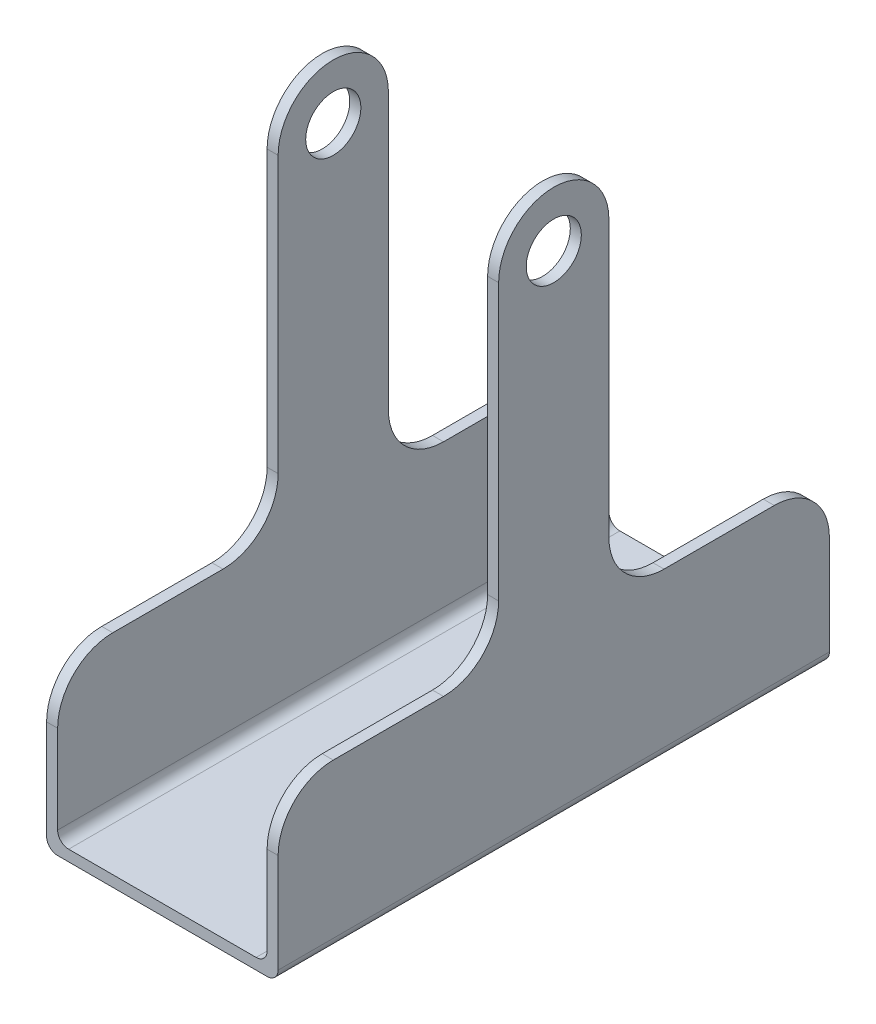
from build123d import *

# Parameters (mm, degrees)
SKETCH1_W          = 19
SKETCH1_H          = 50
EXTRUDE1_DEPTH     = 1
SKETCH3_W          = 50
SKETCH3_H          = 50
SKETCH3_R          = 2.5
EXTRUDE2_DEPTH     = 1
EXTRUDE3_START     = 1
SKETCH4_W          = 50
SKETCH4_H          = 50
SKETCH4_R          = 2.5
EXTRUDE3_DEPTH     = 1
CUT_EXTRUDE1_DEPTH = 74.763134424
FILLET1_R          = 1
FILLET2_R          = 1
FILLET3_R          = 1


with BuildPart() as part:
    # Sketch1 → Extrude1 (new body)
    with BuildSketch(Plane(origin=(0, 0, 0), x_dir=(1, 0, 0), z_dir=(0, 1, 0))):
        with Locations((9.5, 25)):
            Rectangle(SKETCH1_W, SKETCH1_H)
    extrude(amount=EXTRUDE1_DEPTH)

    # Sketch3 → Extrude2 (add)
    with BuildSketch(Plane(origin=(19, 0, 0), x_dir=(0, 0, -1), z_dir=(1, 0, 0))):
        with Locations((25, 25)):
            Rectangle(SKETCH3_W, SKETCH3_H)
        with Locations((25, 45)):
            Circle(SKETCH3_R, mode=Mode.SUBTRACT)
    extrude(amount=EXTRUDE2_DEPTH)

    # Sketch4 → Extrude3 (add)
    with BuildSketch(Plane.ZY.offset(EXTRUDE3_START)):
        with Locations((-25, 25)):
            Rectangle(SKETCH4_W, SKETCH4_H)
        with Locations(Location((-25, 45, 0), (0, 0, 180))):
            Circle(SKETCH4_R, mode=Mode.SUBTRACT)
    extrude(amount=-EXTRUDE3_DEPTH)

    # Sketch5 → Cut-Extrude1 (cut, through all)
    with BuildSketch(Plane.ZY.offset(1)):
        with BuildLine():
            Line((-30, 45), (-30, 20))
            ThreePointArc((-30, 20), (-31.464466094, 16.464466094), (-35, 15))
            Line((-35, 15), (-45, 15))
            ThreePointArc((-45, 15), (-48.535533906, 13.535533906), (-50, 10))
            Line((-50, 10), (-63.781665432, 10))
            Line((-63.781665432, 10), (-63.781665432, 64.035685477))
            Line((-63.781665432, 64.035685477), (11.670472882, 64.035685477))
            Line((11.670472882, 64.035685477), (11.670472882, 10))
            Line((11.670472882, 10), (0, 10))
            ThreePointArc((0, 10), (-1.464466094, 13.535533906), (-5, 15))
            Line((-5, 15), (-15, 15))
            ThreePointArc((-15, 15), (-18.535533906, 16.464466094), (-20, 20))
            Line((-20, 20), (-20, 45))
            ThreePointArc((-20, 45), (-25, 50), (-30, 45))
        make_face()
    extrude(amount=-CUT_EXTRUDE1_DEPTH, mode=Mode.SUBTRACT)

    # Fillet1
    fillet1_edges = [part.edges().sort_by_distance(p)[0] for p in [
        (0, 1, -25),
    ]]
    fillet(fillet1_edges, radius=FILLET1_R)

    # Fillet2
    fillet2_edges = [part.edges().sort_by_distance(p)[0] for p in [
        (19, 1, -25),
    ]]
    fillet(fillet2_edges, radius=FILLET2_R)

    # Fillet3
    fillet3_edges = [part.edges().sort_by_distance(p)[0] for p in [
        (20, 0, -25),
        (-1, 0, -25),
    ]]
    fillet(fillet3_edges, radius=FILLET3_R)


solid = part.part
